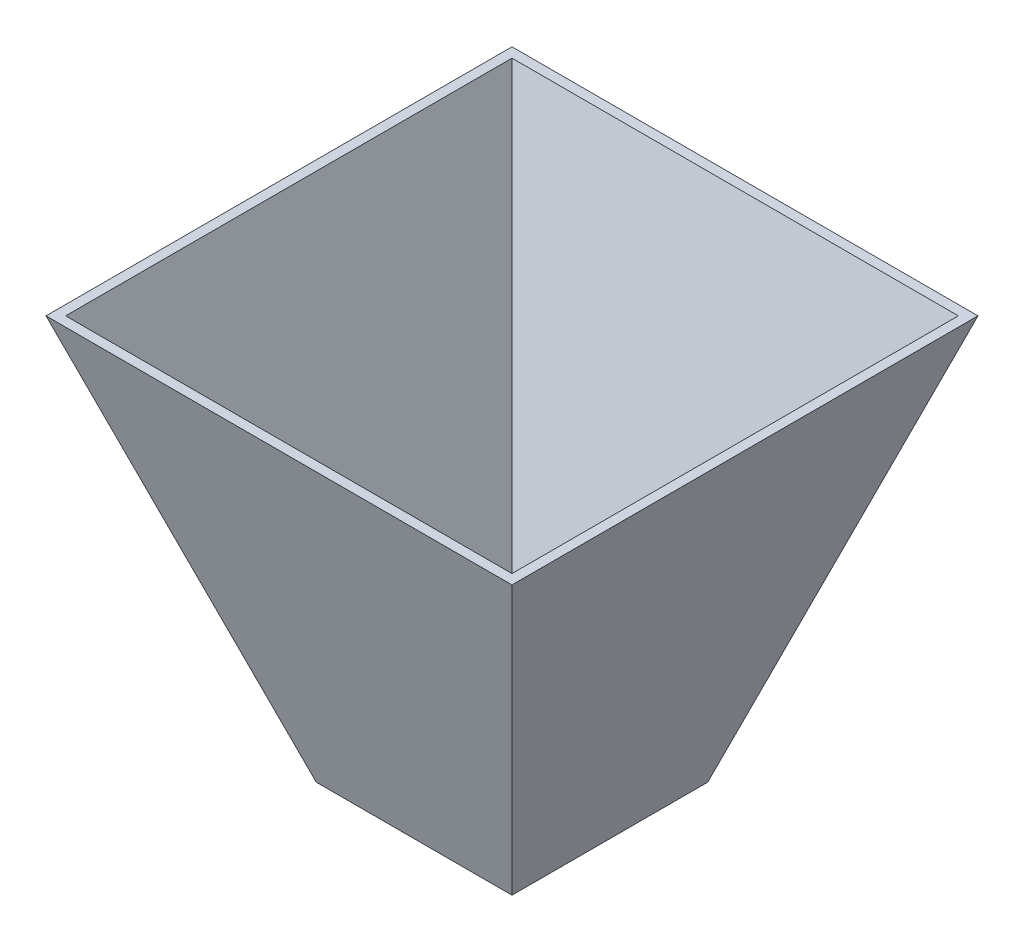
ISO-10303-21;
HEADER;
FILE_DESCRIPTION(('STEP AP214'),'2;1');
FILE_NAME('part.step','',(''),(''),'','','');
FILE_SCHEMA(('AUTOMOTIVE_DESIGN { 1 0 10303 214 1 1 1 1 }'));
ENDSEC;
DATA;
#1=APPLICATION_CONTEXT('core data for automotive mechanical design processes');
#2=APPLICATION_PROTOCOL_DEFINITION('international standard','automotive_design',2000,#1);
#3=PRODUCT_CONTEXT('',#1,'mechanical');
#4=PRODUCT('Part','Part','',(#3));
#5=PRODUCT_RELATED_PRODUCT_CATEGORY('part','',(#4));
#6=PRODUCT_DEFINITION_FORMATION('','',#4);
#7=PRODUCT_DEFINITION_CONTEXT('part definition',#1,'design');
#8=PRODUCT_DEFINITION('design','',#6,#7);
#9=PRODUCT_DEFINITION_SHAPE('','',#8);
#10=(LENGTH_UNIT() NAMED_UNIT(*) SI_UNIT(.MILLI.,.METRE.));
#11=(NAMED_UNIT(*) PLANE_ANGLE_UNIT() SI_UNIT($,.RADIAN.));
#12=(NAMED_UNIT(*) SI_UNIT($,.STERADIAN.) SOLID_ANGLE_UNIT());
#13=UNCERTAINTY_MEASURE_WITH_UNIT(LENGTH_MEASURE(1.E-05),#10,'distance_accuracy_value','');
#14=(GEOMETRIC_REPRESENTATION_CONTEXT(3) GLOBAL_UNCERTAINTY_ASSIGNED_CONTEXT((#13)) GLOBAL_UNIT_ASSIGNED_CONTEXT((#10,
#11,#12)) REPRESENTATION_CONTEXT('',''));
#15=CARTESIAN_POINT('',(0.,0.,0.));
#16=DIRECTION('',(0.,0.,1.));
#17=DIRECTION('',(1.,0.,0.));
#18=AXIS2_PLACEMENT_3D('',#15,#16,#17);
#19=CARTESIAN_POINT('',(0.,0.,0.));
#20=DIRECTION('',(0.,1.,0.));
#21=DIRECTION('',(0.,0.,1.));
#22=AXIS2_PLACEMENT_3D('',#19,#20,#21);
#23=PLANE('',#22);
#24=CARTESIAN_POINT('',(0.,0.,0.));
#25=DIRECTION('',(0.,-1.,0.));
#26=DIRECTION('',(0.,0.,-1.));
#27=AXIS2_PLACEMENT_3D('',#24,#25,#26);
#28=CIRCLE('',#27,31.5);
#29=CARTESIAN_POINT('',(0.,0.,-31.5));
#30=VERTEX_POINT('',#29);
#31=CARTESIAN_POINT('',(31.5,0.,0.));
#32=VERTEX_POINT('',#31);
#33=EDGE_CURVE('E172',#30,#32,#28,.T.);
#34=ORIENTED_EDGE('',*,*,#33,.F.);
#35=DIRECTION('',(-1.,0.,0.));
#36=VECTOR('',#35,1.);
#37=CARTESIAN_POINT('',(-31.5,0.,-31.5));
#38=LINE('',#37,#36);
#39=CARTESIAN_POINT('',(31.5,0.,-31.5));
#40=VERTEX_POINT('',#39);
#41=EDGE_CURVE('E183',#40,#30,#38,.T.);
#42=ORIENTED_EDGE('',*,*,#41,.F.);
#43=DIRECTION('',(0.,0.,-1.));
#44=VECTOR('',#43,1.);
#45=CARTESIAN_POINT('',(31.5,0.,-31.5));
#46=LINE('',#45,#44);
#47=EDGE_CURVE('E302',#32,#40,#46,.T.);
#48=ORIENTED_EDGE('',*,*,#47,.F.);
#49=EDGE_LOOP('',(#34,#42,#48));
#50=FACE_BOUND('',#49,.T.);
#51=ADVANCED_FACE('F45',(#50),#23,.F.);
#52=CARTESIAN_POINT('',(0.,0.,31.5));
#53=VERTEX_POINT('',#52);
#54=EDGE_CURVE('E12',#32,#53,#28,.T.);
#55=ORIENTED_EDGE('',*,*,#54,.F.);
#56=CARTESIAN_POINT('',(31.5,0.,31.5));
#57=VERTEX_POINT('',#56);
#58=EDGE_CURVE('E50',#57,#32,#46,.T.);
#59=ORIENTED_EDGE('',*,*,#58,.F.);
#60=DIRECTION('',(1.,0.,0.));
#61=VECTOR('',#60,1.);
#62=CARTESIAN_POINT('',(-31.5,0.,31.5));
#63=LINE('',#62,#61);
#64=EDGE_CURVE('E206',#53,#57,#63,.T.);
#65=ORIENTED_EDGE('',*,*,#64,.F.);
#66=EDGE_LOOP('',(#55,#59,#65));
#67=FACE_BOUND('',#66,.T.);
#68=ADVANCED_FACE('F374',(#67),#23,.F.);
#69=CARTESIAN_POINT('',(-31.5,0.,0.));
#70=VERTEX_POINT('',#69);
#71=EDGE_CURVE('E56',#53,#70,#28,.T.);
#72=ORIENTED_EDGE('',*,*,#71,.F.);
#73=CARTESIAN_POINT('',(-31.5,0.,31.5));
#74=VERTEX_POINT('',#73);
#75=EDGE_CURVE('E209',#74,#53,#63,.T.);
#76=ORIENTED_EDGE('',*,*,#75,.F.);
#77=DIRECTION('',(0.,0.,1.));
#78=VECTOR('',#77,1.);
#79=CARTESIAN_POINT('',(-31.5,0.,-31.5));
#80=LINE('',#79,#78);
#81=EDGE_CURVE('E201',#70,#74,#80,.T.);
#82=ORIENTED_EDGE('',*,*,#81,.F.);
#83=EDGE_LOOP('',(#72,#76,#82));
#84=FACE_BOUND('',#83,.T.);
#85=ADVANCED_FACE('F378',(#84),#23,.F.);
#86=EDGE_CURVE('E72',#70,#30,#28,.T.);
#87=ORIENTED_EDGE('',*,*,#86,.F.);
#88=CARTESIAN_POINT('',(-31.5,0.,-31.5));
#89=VERTEX_POINT('',#88);
#90=EDGE_CURVE('E203',#89,#70,#80,.T.);
#91=ORIENTED_EDGE('',*,*,#90,.F.);
#92=EDGE_CURVE('E186',#30,#89,#38,.T.);
#93=ORIENTED_EDGE('',*,*,#92,.F.);
#94=EDGE_LOOP('',(#87,#91,#93));
#95=FACE_BOUND('',#94,.T.);
#96=ADVANCED_FACE('F47',(#95),#23,.F.);
#97=CARTESIAN_POINT('',(0.,130.,0.));
#98=DIRECTION('',(0.,1.,0.));
#99=DIRECTION('',(0.,0.,1.));
#100=AXIS2_PLACEMENT_3D('',#97,#98,#99);
#101=PLANE('',#100);
#102=DIRECTION('',(0.,0.,1.));
#103=VECTOR('',#102,1.);
#104=CARTESIAN_POINT('',(-71.8365039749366,130.,0.));
#105=LINE('',#104,#103);
#106=CARTESIAN_POINT('',(-71.8365039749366,130.,-71.8365039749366));
#107=VERTEX_POINT('',#106);
#108=CARTESIAN_POINT('',(-71.8365039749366,130.,71.8365039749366));
#109=VERTEX_POINT('',#108);
#110=EDGE_CURVE('E156',#107,#109,#105,.T.);
#111=ORIENTED_EDGE('',*,*,#110,.F.);
#112=DIRECTION('',(-1.,0.,0.));
#113=VECTOR('',#112,1.);
#114=CARTESIAN_POINT('',(0.,130.,-71.8365039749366));
#115=LINE('',#114,#113);
#116=CARTESIAN_POINT('',(71.8365039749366,130.,-71.8365039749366));
#117=VERTEX_POINT('',#116);
#118=EDGE_CURVE('E159',#117,#107,#115,.T.);
#119=ORIENTED_EDGE('',*,*,#118,.F.);
#120=DIRECTION('',(0.,0.,-1.));
#121=VECTOR('',#120,1.);
#122=CARTESIAN_POINT('',(71.8365039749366,130.,0.));
#123=LINE('',#122,#121);
#124=CARTESIAN_POINT('',(71.8365039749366,130.,71.8365039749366));
#125=VERTEX_POINT('',#124);
#126=EDGE_CURVE('E148',#125,#117,#123,.T.);
#127=ORIENTED_EDGE('',*,*,#126,.F.);
#128=DIRECTION('',(1.,0.,0.));
#129=VECTOR('',#128,1.);
#130=CARTESIAN_POINT('',(0.,130.,71.8365039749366));
#131=LINE('',#130,#129);
#132=EDGE_CURVE('E161',#109,#125,#131,.T.);
#133=ORIENTED_EDGE('',*,*,#132,.F.);
#134=EDGE_LOOP('',(#111,#119,#127,#133));
#135=FACE_BOUND('',#134,.T.);
#136=DIRECTION('',(0.,0.,1.));
#137=VECTOR('',#136,1.);
#138=CARTESIAN_POINT('',(-75.,130.,75.));
#139=LINE('',#138,#137);
#140=CARTESIAN_POINT('',(-75.,130.,-75.));
#141=VERTEX_POINT('',#140);
#142=CARTESIAN_POINT('',(-75.,130.,75.));
#143=VERTEX_POINT('',#142);
#144=EDGE_CURVE('E171',#141,#143,#139,.T.);
#145=ORIENTED_EDGE('',*,*,#144,.T.);
#146=DIRECTION('',(1.,0.,0.));
#147=VECTOR('',#146,1.);
#148=CARTESIAN_POINT('',(75.,130.,75.));
#149=LINE('',#148,#147);
#150=CARTESIAN_POINT('',(75.,130.,75.));
#151=VERTEX_POINT('',#150);
#152=EDGE_CURVE('E429',#143,#151,#149,.T.);
#153=ORIENTED_EDGE('',*,*,#152,.T.);
#154=DIRECTION('',(0.,0.,-1.));
#155=VECTOR('',#154,1.);
#156=CARTESIAN_POINT('',(75.,130.,75.));
#157=LINE('',#156,#155);
#158=CARTESIAN_POINT('',(75.,130.,-75.));
#159=VERTEX_POINT('',#158);
#160=EDGE_CURVE('E309',#151,#159,#157,.T.);
#161=ORIENTED_EDGE('',*,*,#160,.T.);
#162=DIRECTION('',(-1.,0.,0.));
#163=VECTOR('',#162,1.);
#164=CARTESIAN_POINT('',(75.,130.,-75.));
#165=LINE('',#164,#163);
#166=EDGE_CURVE('E291',#159,#141,#165,.T.);
#167=ORIENTED_EDGE('',*,*,#166,.T.);
#168=EDGE_LOOP('',(#145,#153,#161,#167));
#169=FACE_BOUND('',#168,.T.);
#170=ADVANCED_FACE('F361',(#135,#169),#101,.T.);
#171=CARTESIAN_POINT('',(0.,-9.47904056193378,28.3281671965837));
#172=DIRECTION('',(0.,-0.317321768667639,0.948317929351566));
#173=DIRECTION('',(0.,-0.948317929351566,-0.317321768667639));
#174=AXIS2_PLACEMENT_3D('',#171,#172,#173);
#175=PLANE('',#174);
#176=DIRECTION('',(0.302459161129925,-0.903900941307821,-0.302459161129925));
#177=VECTOR('',#176,1.);
#178=CARTESIAN_POINT('',(-75.,130.,75.));
#179=LINE('',#178,#177);
#180=EDGE_CURVE('E432',#143,#74,#179,.T.);
#181=ORIENTED_EDGE('',*,*,#180,.T.);
#182=ORIENTED_EDGE('',*,*,#75,.T.);
#183=ORIENTED_EDGE('',*,*,#64,.T.);
#184=DIRECTION('',(-0.302459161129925,-0.903900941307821,-0.302459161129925));
#185=VECTOR('',#184,1.);
#186=CARTESIAN_POINT('',(75.,130.,75.));
#187=LINE('',#186,#185);
#188=EDGE_CURVE('E283',#151,#57,#187,.T.);
#189=ORIENTED_EDGE('',*,*,#188,.F.);
#190=ORIENTED_EDGE('',*,*,#152,.F.);
#191=EDGE_LOOP('',(#181,#182,#183,#189,#190));
#192=FACE_BOUND('',#191,.T.);
#193=ADVANCED_FACE('F384',(#192),#175,.T.);
#194=CARTESIAN_POINT('',(28.3281671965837,-9.47904056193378,0.));
#195=DIRECTION('',(0.948317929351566,-0.317321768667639,0.));
#196=DIRECTION('',(0.317321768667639,0.948317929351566,0.));
#197=AXIS2_PLACEMENT_3D('',#194,#195,#196);
#198=PLANE('',#197);
#199=ORIENTED_EDGE('',*,*,#188,.T.);
#200=ORIENTED_EDGE('',*,*,#58,.T.);
#201=ORIENTED_EDGE('',*,*,#47,.T.);
#202=DIRECTION('',(-0.302459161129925,-0.903900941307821,0.302459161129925));
#203=VECTOR('',#202,1.);
#204=CARTESIAN_POINT('',(75.,130.,-75.));
#205=LINE('',#204,#203);
#206=EDGE_CURVE('E282',#159,#40,#205,.T.);
#207=ORIENTED_EDGE('',*,*,#206,.F.);
#208=ORIENTED_EDGE('',*,*,#160,.F.);
#209=EDGE_LOOP('',(#199,#200,#201,#207,#208));
#210=FACE_BOUND('',#209,.T.);
#211=ADVANCED_FACE('F262',(#210),#198,.T.);
#212=CARTESIAN_POINT('',(-28.3281671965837,-9.47904056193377,0.));
#213=DIRECTION('',(-0.948317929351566,-0.317321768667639,0.));
#214=DIRECTION('',(0.317321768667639,-0.948317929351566,0.));
#215=AXIS2_PLACEMENT_3D('',#212,#213,#214);
#216=PLANE('',#215);
#217=DIRECTION('',(0.302459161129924,-0.903900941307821,0.302459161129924));
#218=VECTOR('',#217,1.);
#219=CARTESIAN_POINT('',(-75.,130.,-75.));
#220=LINE('',#219,#218);
#221=EDGE_CURVE('E274',#141,#89,#220,.T.);
#222=ORIENTED_EDGE('',*,*,#221,.T.);
#223=ORIENTED_EDGE('',*,*,#90,.T.);
#224=ORIENTED_EDGE('',*,*,#81,.T.);
#225=ORIENTED_EDGE('',*,*,#180,.F.);
#226=ORIENTED_EDGE('',*,*,#144,.F.);
#227=EDGE_LOOP('',(#222,#223,#224,#225,#226));
#228=FACE_BOUND('',#227,.T.);
#229=ADVANCED_FACE('F252',(#228),#216,.T.);
#230=CARTESIAN_POINT('',(0.,-9.47904056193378,-28.3281671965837));
#231=DIRECTION('',(0.,-0.317321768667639,-0.948317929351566));
#232=DIRECTION('',(0.,0.948317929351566,-0.317321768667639));
#233=AXIS2_PLACEMENT_3D('',#230,#231,#232);
#234=PLANE('',#233);
#235=ORIENTED_EDGE('',*,*,#206,.T.);
#236=ORIENTED_EDGE('',*,*,#41,.T.);
#237=ORIENTED_EDGE('',*,*,#92,.T.);
#238=ORIENTED_EDGE('',*,*,#221,.F.);
#239=ORIENTED_EDGE('',*,*,#166,.F.);
#240=EDGE_LOOP('',(#235,#236,#237,#238,#239));
#241=FACE_BOUND('',#240,.T.);
#242=ADVANCED_FACE('F261',(#241),#234,.T.);
#243=CARTESIAN_POINT('',(0.,-0.02,0.));
#244=DIRECTION('',(0.,1.,0.));
#245=DIRECTION('',(0.,0.,1.));
#246=AXIS2_PLACEMENT_3D('',#243,#244,#245);
#247=CYLINDRICAL_SURFACE('',#246,31.5);
#248=CARTESIAN_POINT('',(0.,-0.02,0.));
#249=DIRECTION('',(0.,-1.,0.));
#250=DIRECTION('',(0.,0.,-1.));
#251=AXIS2_PLACEMENT_3D('',#248,#249,#250);
#252=CIRCLE('',#251,31.5);
#253=CARTESIAN_POINT('',(0.,-0.02,-31.5));
#254=VERTEX_POINT('',#253);
#255=EDGE_CURVE('E168',#254,#254,#252,.T.);
#256=ORIENTED_EDGE('',*,*,#255,.F.);
#257=EDGE_LOOP('',(#256));
#258=FACE_BOUND('',#257,.T.);
#259=ORIENTED_EDGE('',*,*,#33,.T.);
#260=ORIENTED_EDGE('',*,*,#54,.T.);
#261=ORIENTED_EDGE('',*,*,#71,.T.);
#262=ORIENTED_EDGE('',*,*,#86,.T.);
#263=EDGE_LOOP('',(#259,#260,#261,#262));
#264=FACE_BOUND('',#263,.T.);
#265=ADVANCED_FACE('F346',(#258,#264),#247,.T.);
#266=CARTESIAN_POINT('',(0.,-0.02,0.));
#267=DIRECTION('',(0.,-1.,0.));
#268=DIRECTION('',(0.,0.,-1.));
#269=AXIS2_PLACEMENT_3D('',#266,#267,#268);
#270=PLANE('',#269);
#271=CARTESIAN_POINT('',(0.,-0.02,0.));
#272=DIRECTION('',(0.,-1.,0.));
#273=DIRECTION('',(0.,0.,-1.));
#274=AXIS2_PLACEMENT_3D('',#271,#272,#273);
#275=CIRCLE('',#274,28.5);
#276=CARTESIAN_POINT('',(0.,-0.02,28.5));
#277=VERTEX_POINT('',#276);
#278=EDGE_CURVE('E160',#277,#277,#275,.T.);
#279=ORIENTED_EDGE('',*,*,#278,.F.);
#280=EDGE_LOOP('',(#279));
#281=FACE_BOUND('',#280,.T.);
#282=ORIENTED_EDGE('',*,*,#255,.T.);
#283=EDGE_LOOP('',(#282));
#284=FACE_BOUND('',#283,.T.);
#285=ADVANCED_FACE('F392',(#281,#284),#270,.T.);
#286=CARTESIAN_POINT('',(0.,3.,0.));
#287=DIRECTION('',(0.,1.,0.));
#288=DIRECTION('',(0.,0.,1.));
#289=AXIS2_PLACEMENT_3D('',#286,#287,#288);
#290=PLANE('',#289);
#291=DIRECTION('',(0.,0.,1.));
#292=VECTOR('',#291,1.);
#293=CARTESIAN_POINT('',(-29.3403501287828,3.,0.));
#294=LINE('',#293,#292);
#295=CARTESIAN_POINT('',(-29.3403501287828,3.,-29.3403501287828));
#296=VERTEX_POINT('',#295);
#297=CARTESIAN_POINT('',(-29.3403501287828,3.,29.3403501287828));
#298=VERTEX_POINT('',#297);
#299=EDGE_CURVE('E144',#296,#298,#294,.T.);
#300=ORIENTED_EDGE('',*,*,#299,.T.);
#301=DIRECTION('',(1.,0.,0.));
#302=VECTOR('',#301,1.);
#303=CARTESIAN_POINT('',(0.,3.,29.3403501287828));
#304=LINE('',#303,#302);
#305=CARTESIAN_POINT('',(29.3403501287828,3.,29.3403501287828));
#306=VERTEX_POINT('',#305);
#307=EDGE_CURVE('E134',#298,#306,#304,.T.);
#308=ORIENTED_EDGE('',*,*,#307,.T.);
#309=DIRECTION('',(0.,0.,-1.));
#310=VECTOR('',#309,1.);
#311=CARTESIAN_POINT('',(29.3403501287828,3.,0.));
#312=LINE('',#311,#310);
#313=CARTESIAN_POINT('',(29.3403501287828,3.,-29.3403501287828));
#314=VERTEX_POINT('',#313);
#315=EDGE_CURVE('E128',#306,#314,#312,.T.);
#316=ORIENTED_EDGE('',*,*,#315,.T.);
#317=DIRECTION('',(-1.,0.,0.));
#318=VECTOR('',#317,1.);
#319=CARTESIAN_POINT('',(0.,3.,-29.3403501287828));
#320=LINE('',#319,#318);
#321=EDGE_CURVE('E131',#314,#296,#320,.T.);
#322=ORIENTED_EDGE('',*,*,#321,.T.);
#323=EDGE_LOOP('',(#300,#308,#316,#322));
#324=FACE_BOUND('',#323,.T.);
#325=CARTESIAN_POINT('',(0.,3.,0.));
#326=DIRECTION('',(0.,1.,0.));
#327=DIRECTION('',(0.,0.,1.));
#328=AXIS2_PLACEMENT_3D('',#325,#326,#327);
#329=CIRCLE('',#328,28.5);
#330=CARTESIAN_POINT('',(0.,3.,28.5));
#331=VERTEX_POINT('',#330);
#332=EDGE_CURVE('E143',#331,#331,#329,.F.);
#333=ORIENTED_EDGE('',*,*,#332,.T.);
#334=EDGE_LOOP('',(#333));
#335=FACE_BOUND('',#334,.T.);
#336=ADVANCED_FACE('F129',(#324,#335),#290,.T.);
#337=CARTESIAN_POINT('',(0.,-8.52707525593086,25.483213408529));
#338=DIRECTION('',(0.,-0.317321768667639,0.948317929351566));
#339=DIRECTION('',(0.,-0.948317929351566,-0.317321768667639));
#340=AXIS2_PLACEMENT_3D('',#337,#338,#339);
#341=PLANE('',#340);
#342=DIRECTION('',(0.302459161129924,-0.903900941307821,-0.302459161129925));
#343=VECTOR('',#342,1.);
#344=CARTESIAN_POINT('',(-23.1519696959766,-15.4940104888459,23.1519696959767));
#345=LINE('',#344,#343);
#346=EDGE_CURVE('E163',#109,#298,#345,.T.);
#347=ORIENTED_EDGE('',*,*,#346,.F.);
#348=ORIENTED_EDGE('',*,*,#132,.T.);
#349=DIRECTION('',(-0.302459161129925,-0.903900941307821,-0.302459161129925));
#350=VECTOR('',#349,1.);
#351=CARTESIAN_POINT('',(23.1519696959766,-15.4940104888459,23.1519696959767));
#352=LINE('',#351,#350);
#353=EDGE_CURVE('E151',#125,#306,#352,.T.);
#354=ORIENTED_EDGE('',*,*,#353,.T.);
#355=ORIENTED_EDGE('',*,*,#307,.F.);
#356=EDGE_LOOP('',(#347,#348,#354,#355));
#357=FACE_BOUND('',#356,.T.);
#358=ADVANCED_FACE('F357',(#357),#341,.F.);
#359=CARTESIAN_POINT('',(25.483213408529,-8.52707525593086,0.));
#360=DIRECTION('',(0.948317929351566,-0.317321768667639,0.));
#361=DIRECTION('',(0.317321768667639,0.948317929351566,0.));
#362=AXIS2_PLACEMENT_3D('',#359,#360,#361);
#363=PLANE('',#362);
#364=ORIENTED_EDGE('',*,*,#353,.F.);
#365=ORIENTED_EDGE('',*,*,#126,.T.);
#366=DIRECTION('',(-0.302459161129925,-0.903900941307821,0.302459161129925));
#367=VECTOR('',#366,1.);
#368=CARTESIAN_POINT('',(23.1519696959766,-15.4940104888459,-23.1519696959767));
#369=LINE('',#368,#367);
#370=EDGE_CURVE('E64',#117,#314,#369,.T.);
#371=ORIENTED_EDGE('',*,*,#370,.T.);
#372=ORIENTED_EDGE('',*,*,#315,.F.);
#373=EDGE_LOOP('',(#364,#365,#371,#372));
#374=FACE_BOUND('',#373,.T.);
#375=ADVANCED_FACE('F146',(#374),#363,.F.);
#376=CARTESIAN_POINT('',(-25.483213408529,-8.52707525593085,0.));
#377=DIRECTION('',(-0.948317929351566,-0.317321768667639,0.));
#378=DIRECTION('',(0.317321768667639,-0.948317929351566,0.));
#379=AXIS2_PLACEMENT_3D('',#376,#377,#378);
#380=PLANE('',#379);
#381=DIRECTION('',(0.302459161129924,-0.903900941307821,0.302459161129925));
#382=VECTOR('',#381,1.);
#383=CARTESIAN_POINT('',(-23.1519696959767,-15.4940104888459,-23.1519696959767));
#384=LINE('',#383,#382);
#385=EDGE_CURVE('E141',#107,#296,#384,.T.);
#386=ORIENTED_EDGE('',*,*,#385,.F.);
#387=ORIENTED_EDGE('',*,*,#110,.T.);
#388=ORIENTED_EDGE('',*,*,#346,.T.);
#389=ORIENTED_EDGE('',*,*,#299,.F.);
#390=EDGE_LOOP('',(#386,#387,#388,#389));
#391=FACE_BOUND('',#390,.T.);
#392=ADVANCED_FACE('F363',(#391),#380,.F.);
#393=CARTESIAN_POINT('',(0.,-8.52707525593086,-25.483213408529));
#394=DIRECTION('',(0.,-0.317321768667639,-0.948317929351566));
#395=DIRECTION('',(0.,0.948317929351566,-0.317321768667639));
#396=AXIS2_PLACEMENT_3D('',#393,#394,#395);
#397=PLANE('',#396);
#398=ORIENTED_EDGE('',*,*,#370,.F.);
#399=ORIENTED_EDGE('',*,*,#118,.T.);
#400=ORIENTED_EDGE('',*,*,#385,.T.);
#401=ORIENTED_EDGE('',*,*,#321,.F.);
#402=EDGE_LOOP('',(#398,#399,#400,#401));
#403=FACE_BOUND('',#402,.T.);
#404=ADVANCED_FACE('F139',(#403),#397,.F.);
#405=CARTESIAN_POINT('',(0.,-0.02,0.));
#406=DIRECTION('',(0.,1.,0.));
#407=DIRECTION('',(0.,0.,1.));
#408=AXIS2_PLACEMENT_3D('',#405,#406,#407);
#409=CYLINDRICAL_SURFACE('',#408,28.5);
#410=CARTESIAN_POINT('',(0.,-0.02,28.5));
#411=CARTESIAN_POINT('',(0.,0.0114583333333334,28.5));
#412=CARTESIAN_POINT('',(0.,0.0429166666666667,28.5));
#413=CARTESIAN_POINT('',(0.,0.105833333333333,28.5));
#414=CARTESIAN_POINT('',(0.,0.137291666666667,28.5));
#415=CARTESIAN_POINT('',(0.,0.200208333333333,28.5));
#416=CARTESIAN_POINT('',(0.,0.231666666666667,28.5));
#417=CARTESIAN_POINT('',(0.,0.294583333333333,28.5));
#418=CARTESIAN_POINT('',(0.,0.326041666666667,28.5));
#419=CARTESIAN_POINT('',(0.,0.388958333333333,28.5));
#420=CARTESIAN_POINT('',(0.,0.420416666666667,28.5));
#421=CARTESIAN_POINT('',(0.,0.483333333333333,28.5));
#422=CARTESIAN_POINT('',(0.,0.514791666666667,28.5));
#423=CARTESIAN_POINT('',(0.,0.577708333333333,28.5));
#424=CARTESIAN_POINT('',(0.,0.609166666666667,28.5));
#425=CARTESIAN_POINT('',(0.,0.672083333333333,28.5));
#426=CARTESIAN_POINT('',(0.,0.703541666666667,28.5));
#427=CARTESIAN_POINT('',(0.,0.766458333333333,28.5));
#428=CARTESIAN_POINT('',(0.,0.797916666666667,28.5));
#429=CARTESIAN_POINT('',(0.,0.860833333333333,28.5));
#430=CARTESIAN_POINT('',(0.,0.892291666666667,28.5));
#431=CARTESIAN_POINT('',(0.,0.955208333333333,28.5));
#432=CARTESIAN_POINT('',(0.,0.986666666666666,28.5));
#433=CARTESIAN_POINT('',(0.,1.04958333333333,28.5));
#434=CARTESIAN_POINT('',(0.,1.08104166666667,28.5));
#435=CARTESIAN_POINT('',(0.,1.14395833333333,28.5));
#436=CARTESIAN_POINT('',(0.,1.17541666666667,28.5));
#437=CARTESIAN_POINT('',(0.,1.23833333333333,28.5));
#438=CARTESIAN_POINT('',(0.,1.26979166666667,28.5));
#439=CARTESIAN_POINT('',(0.,1.33270833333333,28.5));
#440=CARTESIAN_POINT('',(0.,1.36416666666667,28.5));
#441=CARTESIAN_POINT('',(0.,1.42708333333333,28.5));
#442=CARTESIAN_POINT('',(0.,1.45854166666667,28.5));
#443=CARTESIAN_POINT('',(0.,1.52145833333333,28.5));
#444=CARTESIAN_POINT('',(0.,1.55291666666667,28.5));
#445=CARTESIAN_POINT('',(0.,1.61583333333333,28.5));
#446=CARTESIAN_POINT('',(0.,1.64729166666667,28.5));
#447=CARTESIAN_POINT('',(0.,1.71020833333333,28.5));
#448=CARTESIAN_POINT('',(0.,1.74166666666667,28.5));
#449=CARTESIAN_POINT('',(0.,1.80458333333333,28.5));
#450=CARTESIAN_POINT('',(0.,1.83604166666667,28.5));
#451=CARTESIAN_POINT('',(0.,1.89895833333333,28.5));
#452=CARTESIAN_POINT('',(0.,1.93041666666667,28.5));
#453=CARTESIAN_POINT('',(0.,1.99333333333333,28.5));
#454=CARTESIAN_POINT('',(0.,2.02479166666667,28.5));
#455=CARTESIAN_POINT('',(0.,2.08770833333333,28.5));
#456=CARTESIAN_POINT('',(0.,2.11916666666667,28.5));
#457=CARTESIAN_POINT('',(0.,2.18208333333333,28.5));
#458=CARTESIAN_POINT('',(0.,2.21354166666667,28.5));
#459=CARTESIAN_POINT('',(0.,2.27645833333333,28.5));
#460=CARTESIAN_POINT('',(0.,2.30791666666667,28.5));
#461=CARTESIAN_POINT('',(0.,2.37083333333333,28.5));
#462=CARTESIAN_POINT('',(0.,2.40229166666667,28.5));
#463=CARTESIAN_POINT('',(0.,2.46520833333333,28.5));
#464=CARTESIAN_POINT('',(0.,2.49666666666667,28.5));
#465=CARTESIAN_POINT('',(0.,2.55958333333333,28.5));
#466=CARTESIAN_POINT('',(0.,2.59104166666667,28.5));
#467=CARTESIAN_POINT('',(0.,2.65395833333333,28.5));
#468=CARTESIAN_POINT('',(0.,2.68541666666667,28.5));
#469=CARTESIAN_POINT('',(0.,2.74833333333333,28.5));
#470=CARTESIAN_POINT('',(0.,2.77979166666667,28.5));
#471=CARTESIAN_POINT('',(0.,2.84270833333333,28.5));
#472=CARTESIAN_POINT('',(0.,2.87416666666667,28.5));
#473=CARTESIAN_POINT('',(0.,2.93708333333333,28.5));
#474=CARTESIAN_POINT('',(0.,2.96854166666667,28.5));
#475=CARTESIAN_POINT('',(0.,3.,28.5));
#476=B_SPLINE_CURVE_WITH_KNOTS('',3,(#410,#411,#412,#413,#414,#415,#416,#417,#418,#419,#420,
#421,#422,#423,#424,#425,#426,#427,#428,#429,#430,#431,#432,#433,#434,#435,#436,#437,#438,#439,
#440,#441,#442,#443,#444,#445,#446,#447,#448,#449,#450,#451,#452,#453,#454,#455,#456,#457,#458,
#459,#460,#461,#462,#463,#464,#465,#466,#467,#468,#469,#470,#471,#472,#473,#474,#475),
.UNSPECIFIED.,.F.,.F.,(4,2,2,2,2,2,2,2,2,2,2,2,2,2,2,2,2,2,2,2,2,2,2,2,2,2,2,2,2,2,2,2,4),(0.,
0.094375,0.18875,0.283125,0.3775,0.471875,0.56625,0.660625,0.755,0.849375,0.94375,1.038125,
1.1325,1.226875,1.32125,1.415625,1.51,1.604375,1.69875,1.793125,1.8875,1.981875,2.07625,
2.170625,2.265,2.359375,2.45375,2.548125,2.6425,2.736875,2.83125,2.925625,3.02),.UNSPECIFIED.);
#477=EDGE_CURVE('BSEAM370',#277,#331,#476,.T.);
#478=ORIENTED_EDGE('',*,*,#278,.T.);
#479=ORIENTED_EDGE('',*,*,#332,.F.);
#480=ORIENTED_EDGE('',*,*,#477,.T.);
#481=ORIENTED_EDGE('',*,*,#477,.F.);
#482=EDGE_LOOP('',(#478,#480,#479,#481));
#483=FACE_BOUND('',#482,.T.);
#484=ADVANCED_FACE('F370',(#483),#409,.F.);
#485=CLOSED_SHELL('',(#51,#68,#85,#96,#170,#193,#211,#229,#242,#265,#285,#336,#358,#375,#392,
#404,#484));
#486=MANIFOLD_SOLID_BREP('B2',#485);
#487=ADVANCED_BREP_SHAPE_REPRESENTATION('',(#18,#486),#14);
#488=SHAPE_DEFINITION_REPRESENTATION(#9,#487);
ENDSEC;
END-ISO-10303-21;
